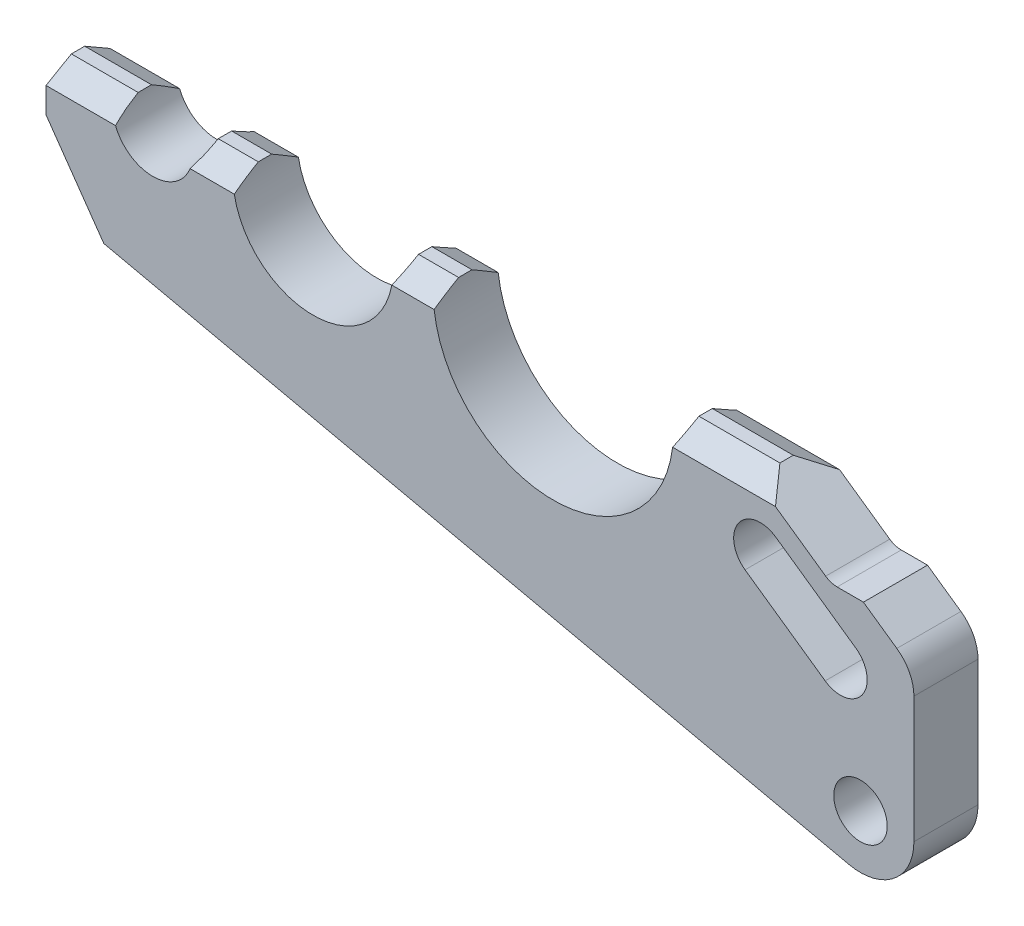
from build123d import *

# Parameters (mm, degrees)
SKETCH2_R          = 2
EXTRUDE1_DEPTH     = 4.8
SKETCH3_OUTSIDE_W  = 20.536
SKETCH3_OUTSIDE_H  = 37.386
CUT_EXTRUDE1_DEPTH = 105.881162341


with BuildPart() as part:
    # Sketch2 → Extrude1 (new body)
    with BuildSketch(Plane.XY):
        with BuildLine():
            Line((94.423448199, 53.607196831), (91.922027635, 55.358710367))
            Line((91.922027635, 55.358710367), (89.954150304, 55.358710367))
            ThreePointArc((89.954150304, 55.358710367), (89.503091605, 55.42813494), (89.09378565, 55.6299823))
            Line((89.09378565, 55.6299823), (83.768610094, 59.358710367))
            Line((83.768610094, 59.358710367), (77.70271889, 59.358710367))
            ThreePointArc((77.70271889, 59.358710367), (77.684104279, 58.780163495), (77.628337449, 58.204009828))
            ThreePointArc((77.628337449, 58.204009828), (68.70271889, 50.358710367), (59.77710033, 58.204009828))
            ThreePointArc((59.77710033, 58.204009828), (59.7213335, 58.780163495), (59.70271889, 59.358710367))
            Line((59.70271889, 59.358710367), (56.70271889, 59.358710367))
            ThreePointArc((56.70271889, 59.358710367), (56.674613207, 58.778642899), (56.590559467, 58.204009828))
            ThreePointArc((56.590559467, 58.204009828), (50.70271889, 53.358710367), (44.814878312, 58.204009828))
            ThreePointArc((44.814878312, 58.204009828), (44.730824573, 58.778642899), (44.70271889, 59.358710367))
            Line((44.70271889, 59.358710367), (41.70271889, 59.358710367))
            ThreePointArc((41.70271889, 59.358710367), (41.644370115, 58.769908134), (41.471593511, 58.204009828))
            ThreePointArc((41.471593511, 58.204009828), (38.70271889, 56.358710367), (35.933844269, 58.204009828))
            ThreePointArc((35.933844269, 58.204009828), (35.761067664, 58.769908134), (35.70271889, 59.358710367))
            Line((35.70271889, 59.358710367), (30.70271889, 59.358710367))
            Line((30.70271889, 59.358710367), (30.70271889, 58.204009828))
            Line((30.70271889, 58.204009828), (30.70271889, 56.358710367))
            Line((30.70271889, 56.358710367), (35.032553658, 50.175065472))
            Line((35.032553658, 50.175065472), (90.836960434, 37.803526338))
            ThreePointArc((90.836960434, 37.803526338), (94.206412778, 38.589172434), (95.70271889, 41.708710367))
            Line((95.70271889, 41.708710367), (95.70271889, 51.149740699))
            ThreePointArc((95.70271889, 51.149740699), (95.363751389, 52.534986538), (94.423448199, 53.607196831))
        make_face()
        with Locations((91.70271889, 41.708710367)):
            Circle(SKETCH2_R, mode=Mode.SUBTRACT)
        with BuildLine():
            Line((83.055566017, 53.021651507), (89.055566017, 48.820406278))
            ThreePointArc((89.055566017, 48.820406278), (91.841022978, 49.311557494), (91.349871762, 52.097014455))
            Line((91.349871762, 52.097014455), (85.349871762, 56.298259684))
            ThreePointArc((85.349871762, 56.298259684), (82.564414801, 55.807108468), (83.055566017, 53.021651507))
        make_face(mode=Mode.SUBTRACT)
    extrude(amount=-EXTRUDE1_DEPTH)

    # Sketch3 outside → Cut-Extrude1 (cut, through all)
    with BuildSketch(Plane(origin=(117.036731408, 0, 0), x_dir=(0, 0, -1), z_dir=(1, 0, 0))):
        with Locations((2.4, 48.534)):
            Rectangle(SKETCH3_OUTSIDE_W, SKETCH3_OUTSIDE_H)
        Polygon((0, 37.708710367), (4.8, 37.708710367), (4.8, 58.261744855), (2.9, 59.358710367), (1.9, 59.358710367), (0, 58.261744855), align=None, mode=Mode.SUBTRACT)
    extrude(amount=-CUT_EXTRUDE1_DEPTH, mode=Mode.SUBTRACT)


solid = part.part
